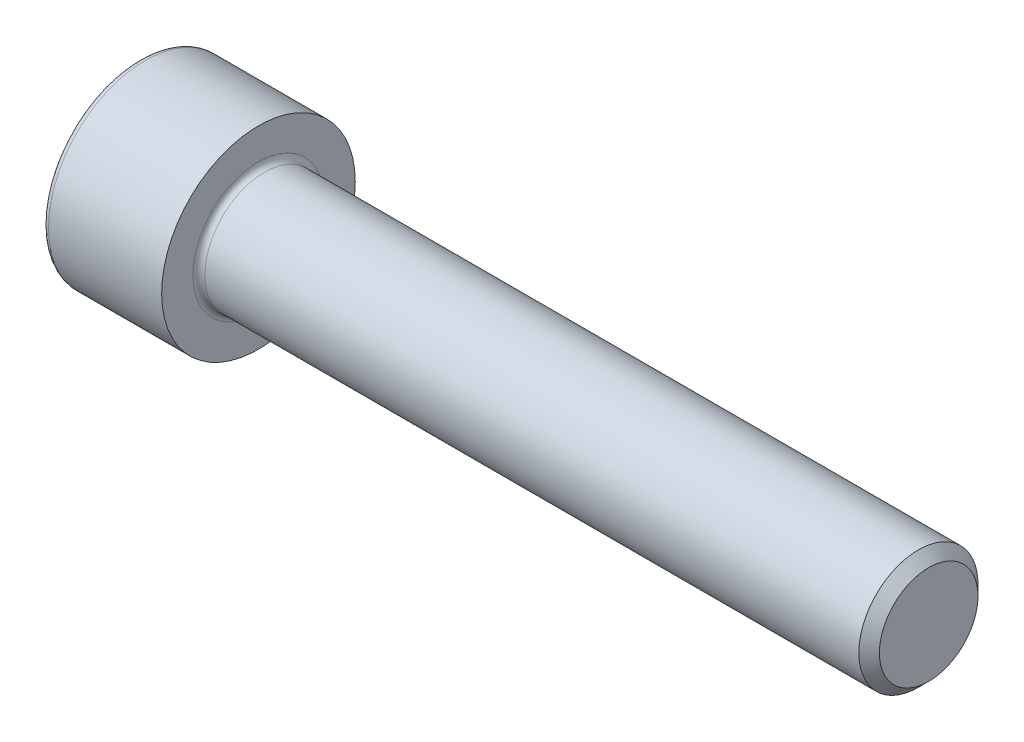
from build123d import *

# Parameters (mm, degrees)
FILLET1_R   = 0.4
FILLET2_R   = 0.4
HEX_2_DEPTH = 4


with BuildPart() as part:
    # BodySke → Base-Revolve (revolve)
    with BuildSketch(Plane.XY, mode=Mode.PRIVATE) as base_revolve_sk:
        Polygon((0, 0), (0, 6.5), (8, 6.5), (8, 4), (52.3095, 4), (53, 3.3095), (53, 0), align=None)
    revolve(base_revolve_sk.sketch.rotate(Axis((-31.75, 0, 0), (1, 0, 0)), 90), axis=Axis((-31.75, 0, 0), (1, 0, 0)))

    # Fillet1
    fillet1_edges = [part.edges().sort_by_distance(p)[0] for p in [
        (8, 0, -4),
    ]]
    fillet(fillet1_edges, radius=FILLET1_R)

    # Fillet2
    fillet2_edges = [part.edges().sort_by_distance(p)[0] for p in [
        (0, 0, -6.5),
    ]]
    fillet(fillet2_edges, radius=FILLET2_R)

    # Sketch2 → Hex-PreBroach (revolve, cut)
    with BuildSketch(Plane.XY, mode=Mode.PRIVATE) as hex_prebroach_sk:
        Polygon((0, 3.0475), (4, 3.0475), (5.759474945, 0), (0, 0), align=None)
    revolve(hex_prebroach_sk.sketch.rotate(Axis((0, 0, 0), (1, 0, 0)), 90), axis=Axis((0, 0, 0), (1, 0, 0)), mode=Mode.SUBTRACT)

    # Sketch3 → Hex 2 (cut)
    with BuildSketch(Plane(origin=(0, 0, 0), x_dir=(0, 0.500000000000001, 0.866025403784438), z_dir=(-1, 0, 0))):
        Polygon((1.759474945, 3.0475), (-1.759474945, 3.0475), (-3.518949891, 0), (-1.759474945, -3.0475), (1.759474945, -3.0475), (3.518949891, 0), align=None)
    extrude(amount=-HEX_2_DEPTH, mode=Mode.SUBTRACT)


solid = part.part
